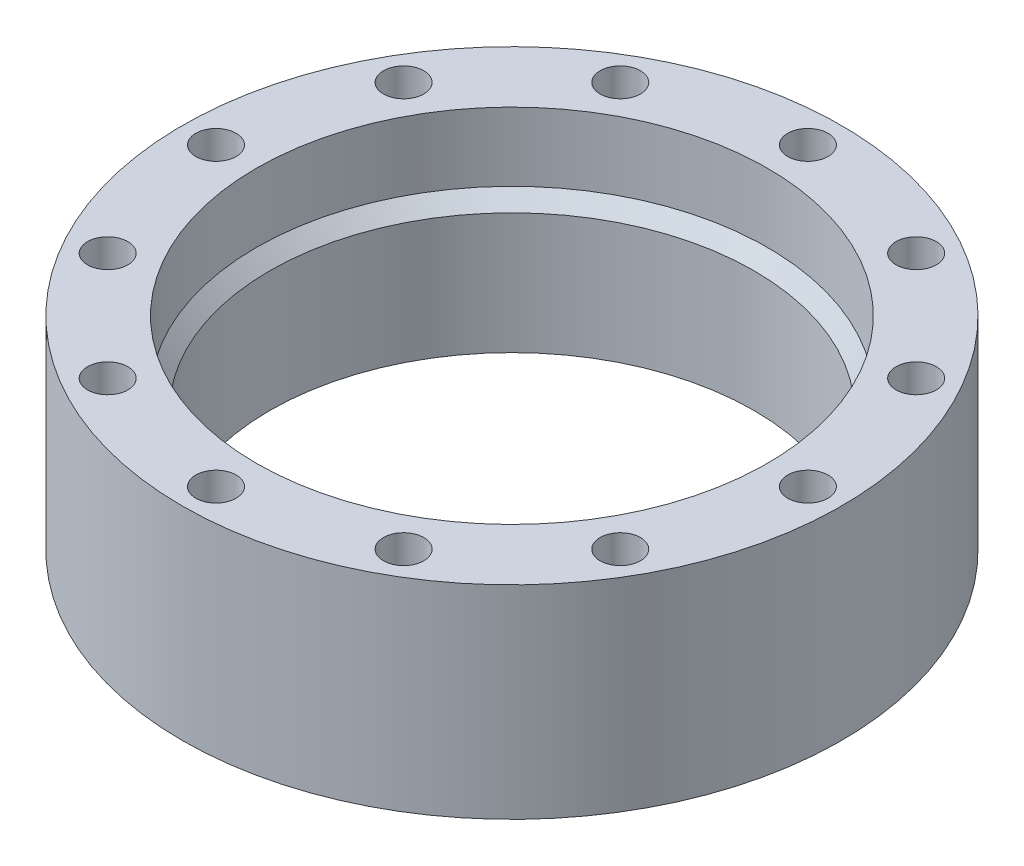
ISO-10303-21;
HEADER;
FILE_DESCRIPTION(('STEP AP214'),'2;1');
FILE_NAME('part.step','',(''),(''),'','','');
FILE_SCHEMA(('AUTOMOTIVE_DESIGN { 1 0 10303 214 1 1 1 1 }'));
ENDSEC;
DATA;
#1=APPLICATION_CONTEXT('core data for automotive mechanical design processes');
#2=APPLICATION_PROTOCOL_DEFINITION('international standard','automotive_design',2000,#1);
#3=PRODUCT_CONTEXT('',#1,'mechanical');
#4=PRODUCT('Part','Part','',(#3));
#5=PRODUCT_RELATED_PRODUCT_CATEGORY('part','',(#4));
#6=PRODUCT_DEFINITION_FORMATION('','',#4);
#7=PRODUCT_DEFINITION_CONTEXT('part definition',#1,'design');
#8=PRODUCT_DEFINITION('design','',#6,#7);
#9=PRODUCT_DEFINITION_SHAPE('','',#8);
#10=(LENGTH_UNIT() NAMED_UNIT(*) SI_UNIT(.MILLI.,.METRE.));
#11=(NAMED_UNIT(*) PLANE_ANGLE_UNIT() SI_UNIT($,.RADIAN.));
#12=(NAMED_UNIT(*) SI_UNIT($,.STERADIAN.) SOLID_ANGLE_UNIT());
#13=UNCERTAINTY_MEASURE_WITH_UNIT(LENGTH_MEASURE(1.E-05),#10,'distance_accuracy_value','');
#14=(GEOMETRIC_REPRESENTATION_CONTEXT(3) GLOBAL_UNCERTAINTY_ASSIGNED_CONTEXT((#13)) GLOBAL_UNIT_ASSIGNED_CONTEXT((#10,
#11,#12)) REPRESENTATION_CONTEXT('',''));
#15=CARTESIAN_POINT('',(0.,0.,0.));
#16=DIRECTION('',(0.,0.,1.));
#17=DIRECTION('',(1.,0.,0.));
#18=AXIS2_PLACEMENT_3D('',#15,#16,#17);
#19=CARTESIAN_POINT('',(0.,15.1,0.));
#20=DIRECTION('',(0.,1.,0.));
#21=DIRECTION('',(0.,0.,1.));
#22=AXIS2_PLACEMENT_3D('',#19,#20,#21);
#23=PLANE('',#22);
#24=CARTESIAN_POINT('',(-19.0525588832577,15.1,10.9999999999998));
#25=DIRECTION('',(0.,1.,0.));
#26=DIRECTION('',(0.,0.,1.));
#27=AXIS2_PLACEMENT_3D('',#24,#25,#26);
#28=CIRCLE('',#27,1.5);
#29=CARTESIAN_POINT('',(-19.0525588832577,15.1,12.4999999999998));
#30=VERTEX_POINT('',#29);
#31=EDGE_CURVE('E115',#30,#30,#28,.T.);
#32=ORIENTED_EDGE('',*,*,#31,.F.);
#33=EDGE_LOOP('',(#32));
#34=FACE_BOUND('',#33,.T.);
#35=CARTESIAN_POINT('',(-11.0000000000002,15.1,19.0525588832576));
#36=DIRECTION('',(0.,1.,0.));
#37=DIRECTION('',(0.,0.,1.));
#38=AXIS2_PLACEMENT_3D('',#35,#36,#37);
#39=CIRCLE('',#38,1.5);
#40=CARTESIAN_POINT('',(-11.0000000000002,15.1,20.5525588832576));
#41=VERTEX_POINT('',#40);
#42=EDGE_CURVE('E123',#41,#41,#39,.T.);
#43=ORIENTED_EDGE('',*,*,#42,.F.);
#44=EDGE_LOOP('',(#43));
#45=FACE_BOUND('',#44,.T.);
#46=CARTESIAN_POINT('',(-1.53602910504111E-13,15.1,22.));
#47=DIRECTION('',(0.,1.,0.));
#48=DIRECTION('',(0.,0.,1.));
#49=AXIS2_PLACEMENT_3D('',#46,#47,#48);
#50=CIRCLE('',#49,1.5);
#51=CARTESIAN_POINT('',(-1.53602910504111E-13,15.1,23.5));
#52=VERTEX_POINT('',#51);
#53=EDGE_CURVE('E129',#52,#52,#50,.T.);
#54=ORIENTED_EDGE('',*,*,#53,.F.);
#55=EDGE_LOOP('',(#54));
#56=FACE_BOUND('',#55,.T.);
#57=CARTESIAN_POINT('',(10.9999999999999,15.1,19.0525588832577));
#58=DIRECTION('',(0.,1.,0.));
#59=DIRECTION('',(0.,0.,1.));
#60=AXIS2_PLACEMENT_3D('',#57,#58,#59);
#61=CIRCLE('',#60,1.5);
#62=CARTESIAN_POINT('',(10.9999999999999,15.1,20.5525588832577));
#63=VERTEX_POINT('',#62);
#64=EDGE_CURVE('E83',#63,#63,#61,.T.);
#65=ORIENTED_EDGE('',*,*,#64,.F.);
#66=EDGE_LOOP('',(#65));
#67=FACE_BOUND('',#66,.T.);
#68=CARTESIAN_POINT('',(19.0525588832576,15.1,11.0000000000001));
#69=DIRECTION('',(0.,1.,0.));
#70=DIRECTION('',(0.,0.,1.));
#71=AXIS2_PLACEMENT_3D('',#68,#69,#70);
#72=CIRCLE('',#71,1.5);
#73=CARTESIAN_POINT('',(19.0525588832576,15.1,12.5000000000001));
#74=VERTEX_POINT('',#73);
#75=EDGE_CURVE('E80',#74,#74,#72,.T.);
#76=ORIENTED_EDGE('',*,*,#75,.F.);
#77=EDGE_LOOP('',(#76));
#78=FACE_BOUND('',#77,.T.);
#79=CARTESIAN_POINT('',(22.,15.1,0.));
#80=DIRECTION('',(0.,1.,0.));
#81=DIRECTION('',(0.,0.,1.));
#82=AXIS2_PLACEMENT_3D('',#79,#80,#81);
#83=CIRCLE('',#82,1.5);
#84=CARTESIAN_POINT('',(22.,15.1,1.50000000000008));
#85=VERTEX_POINT('',#84);
#86=EDGE_CURVE('E90',#85,#85,#83,.T.);
#87=ORIENTED_EDGE('',*,*,#86,.F.);
#88=EDGE_LOOP('',(#87));
#89=FACE_BOUND('',#88,.T.);
#90=CARTESIAN_POINT('',(19.0525588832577,15.1,-11.));
#91=DIRECTION('',(0.,1.,0.));
#92=DIRECTION('',(0.,0.,1.));
#93=AXIS2_PLACEMENT_3D('',#90,#91,#92);
#94=CIRCLE('',#93,1.5);
#95=CARTESIAN_POINT('',(19.0525588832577,15.1,-9.49999999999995));
#96=VERTEX_POINT('',#95);
#97=EDGE_CURVE('E100',#96,#96,#94,.T.);
#98=ORIENTED_EDGE('',*,*,#97,.F.);
#99=EDGE_LOOP('',(#98));
#100=FACE_BOUND('',#99,.T.);
#101=CARTESIAN_POINT('',(11.,15.1,-19.0525588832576));
#102=DIRECTION('',(0.,1.,0.));
#103=DIRECTION('',(0.,0.,1.));
#104=AXIS2_PLACEMENT_3D('',#101,#102,#103);
#105=CIRCLE('',#104,1.5);
#106=CARTESIAN_POINT('',(11.,15.1,-17.5525588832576));
#107=VERTEX_POINT('',#106);
#108=EDGE_CURVE('E75',#107,#107,#105,.T.);
#109=ORIENTED_EDGE('',*,*,#108,.F.);
#110=EDGE_LOOP('',(#109));
#111=FACE_BOUND('',#110,.T.);
#112=CARTESIAN_POINT('',(-22.,15.1,-2.3041549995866E-13));
#113=DIRECTION('',(0.,1.,0.));
#114=DIRECTION('',(0.,0.,1.));
#115=AXIS2_PLACEMENT_3D('',#112,#113,#114);
#116=CIRCLE('',#115,1.5);
#117=CARTESIAN_POINT('',(-22.,15.1,1.49999999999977));
#118=VERTEX_POINT('',#117);
#119=EDGE_CURVE('E114',#118,#118,#116,.T.);
#120=ORIENTED_EDGE('',*,*,#119,.F.);
#121=EDGE_LOOP('',(#120));
#122=FACE_BOUND('',#121,.T.);
#123=CARTESIAN_POINT('',(-19.0525588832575,15.1,-11.0000000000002));
#124=DIRECTION('',(0.,1.,0.));
#125=DIRECTION('',(0.,0.,1.));
#126=AXIS2_PLACEMENT_3D('',#123,#124,#125);
#127=CIRCLE('',#126,1.5);
#128=CARTESIAN_POINT('',(-19.0525588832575,15.1,-9.50000000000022));
#129=VERTEX_POINT('',#128);
#130=EDGE_CURVE('E153',#129,#129,#127,.T.);
#131=ORIENTED_EDGE('',*,*,#130,.F.);
#132=EDGE_LOOP('',(#131));
#133=FACE_BOUND('',#132,.T.);
#134=CARTESIAN_POINT('',(-10.9999999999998,15.1,-19.0525588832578));
#135=DIRECTION('',(0.,1.,0.));
#136=DIRECTION('',(0.,0.,1.));
#137=AXIS2_PLACEMENT_3D('',#134,#135,#136);
#138=CIRCLE('',#137,1.5);
#139=CARTESIAN_POINT('',(-10.9999999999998,15.1,-17.5525588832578));
#140=VERTEX_POINT('',#139);
#141=EDGE_CURVE('E145',#140,#140,#138,.T.);
#142=ORIENTED_EDGE('',*,*,#141,.F.);
#143=EDGE_LOOP('',(#142));
#144=FACE_BOUND('',#143,.T.);
#145=CARTESIAN_POINT('',(0.,15.1,-22.));
#146=DIRECTION('',(0.,1.,0.));
#147=DIRECTION('',(0.,0.,1.));
#148=AXIS2_PLACEMENT_3D('',#145,#146,#147);
#149=CIRCLE('',#148,1.5);
#150=CARTESIAN_POINT('',(0.,15.1,-20.5));
#151=VERTEX_POINT('',#150);
#152=EDGE_CURVE('E66',#151,#151,#149,.T.);
#153=ORIENTED_EDGE('',*,*,#152,.F.);
#154=EDGE_LOOP('',(#153));
#155=FACE_BOUND('',#154,.T.);
#156=CARTESIAN_POINT('',(0.,15.1,0.));
#157=DIRECTION('',(0.,1.,0.));
#158=DIRECTION('',(0.,0.,1.));
#159=AXIS2_PLACEMENT_3D('',#156,#157,#158);
#160=CIRCLE('',#159,24.5);
#161=CARTESIAN_POINT('',(0.,15.1,24.5));
#162=VERTEX_POINT('',#161);
#163=EDGE_CURVE('E51',#162,#162,#160,.T.);
#164=ORIENTED_EDGE('',*,*,#163,.T.);
#165=EDGE_LOOP('',(#164));
#166=FACE_BOUND('',#165,.T.);
#167=CARTESIAN_POINT('',(0.,15.1,0.));
#168=DIRECTION('',(0.,1.,0.));
#169=DIRECTION('',(0.,0.,1.));
#170=AXIS2_PLACEMENT_3D('',#167,#168,#169);
#171=CIRCLE('',#170,19.);
#172=CARTESIAN_POINT('',(0.,15.1,19.));
#173=VERTEX_POINT('',#172);
#174=EDGE_CURVE('E62',#173,#173,#171,.T.);
#175=ORIENTED_EDGE('',*,*,#174,.F.);
#176=EDGE_LOOP('',(#175));
#177=FACE_BOUND('',#176,.T.);
#178=ADVANCED_FACE('F43',(#34,#45,#56,#67,#78,#89,#100,#111,#122,#133,#144,#155,#166,#177),#23,.T.);
#179=CARTESIAN_POINT('',(0.,0.,0.));
#180=DIRECTION('',(0.,1.,0.));
#181=DIRECTION('',(0.,0.,1.));
#182=AXIS2_PLACEMENT_3D('',#179,#180,#181);
#183=PLANE('',#182);
#184=CARTESIAN_POINT('',(0.,0.,0.));
#185=DIRECTION('',(0.,1.,0.));
#186=DIRECTION('',(0.,0.,1.));
#187=AXIS2_PLACEMENT_3D('',#184,#185,#186);
#188=CIRCLE('',#187,24.5);
#189=CARTESIAN_POINT('',(0.,0.,24.5));
#190=VERTEX_POINT('',#189);
#191=EDGE_CURVE('E57',#190,#190,#188,.T.);
#192=ORIENTED_EDGE('',*,*,#191,.F.);
#193=EDGE_LOOP('',(#192));
#194=FACE_BOUND('',#193,.T.);
#195=CARTESIAN_POINT('',(0.,-1.80405208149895E-13,0.));
#196=DIRECTION('',(0.,-1.,0.));
#197=DIRECTION('',(1.,0.,0.));
#198=AXIS2_PLACEMENT_3D('',#195,#196,#197);
#199=CIRCLE('',#198,18.);
#200=CARTESIAN_POINT('',(18.,0.,0.));
#201=VERTEX_POINT('',#200);
#202=EDGE_CURVE('E144',#201,#201,#199,.T.);
#203=ORIENTED_EDGE('',*,*,#202,.F.);
#204=EDGE_LOOP('',(#203));
#205=FACE_BOUND('',#204,.T.);
#206=ADVANCED_FACE('F190',(#194,#205),#183,.F.);
#207=CARTESIAN_POINT('',(0.,15.1,0.));
#208=DIRECTION('',(0.,-1.,0.));
#209=DIRECTION('',(0.,0.,-1.));
#210=AXIS2_PLACEMENT_3D('',#207,#208,#209);
#211=CYLINDRICAL_SURFACE('',#210,24.5);
#212=ORIENTED_EDGE('',*,*,#163,.F.);
#213=EDGE_LOOP('',(#212));
#214=FACE_BOUND('',#213,.T.);
#215=ORIENTED_EDGE('',*,*,#191,.T.);
#216=EDGE_LOOP('',(#215));
#217=FACE_BOUND('',#216,.T.);
#218=ADVANCED_FACE('F44',(#214,#217),#211,.T.);
#219=CARTESIAN_POINT('',(0.,15.1,0.));
#220=DIRECTION('',(0.,-1.,0.));
#221=DIRECTION('',(0.,0.,-1.));
#222=AXIS2_PLACEMENT_3D('',#219,#220,#221);
#223=CYLINDRICAL_SURFACE('',#222,19.);
#224=CARTESIAN_POINT('',(-1.01670879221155E-13,9.99999999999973,0.));
#225=DIRECTION('',(0.,1.,0.));
#226=DIRECTION('',(-1.,0.,0.));
#227=AXIS2_PLACEMENT_3D('',#224,#225,#226);
#228=CIRCLE('',#227,19.);
#229=CARTESIAN_POINT('',(-19.0000000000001,9.99999999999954,0.));
#230=VERTEX_POINT('',#229);
#231=EDGE_CURVE('E10',#230,#230,#228,.T.);
#232=ORIENTED_EDGE('',*,*,#231,.F.);
#233=EDGE_LOOP('',(#232));
#234=FACE_BOUND('',#233,.T.);
#235=ORIENTED_EDGE('',*,*,#174,.T.);
#236=EDGE_LOOP('',(#235));
#237=FACE_BOUND('',#236,.T.);
#238=ADVANCED_FACE('F205',(#234,#237),#223,.F.);
#239=CARTESIAN_POINT('',(0.,8.1,-22.));
#240=DIRECTION('',(0.,1.,0.));
#241=DIRECTION('',(0.,0.,1.));
#242=AXIS2_PLACEMENT_3D('',#239,#240,#241);
#243=CYLINDRICAL_SURFACE('',#242,1.5);
#244=CARTESIAN_POINT('',(0.,8.1,-22.));
#245=DIRECTION('',(0.,1.,0.));
#246=DIRECTION('',(0.,0.,1.));
#247=AXIS2_PLACEMENT_3D('',#244,#245,#246);
#248=CIRCLE('',#247,1.5);
#249=CARTESIAN_POINT('',(0.,8.1,-20.5));
#250=VERTEX_POINT('',#249);
#251=EDGE_CURVE('E70',#250,#250,#248,.T.);
#252=ORIENTED_EDGE('',*,*,#251,.F.);
#253=EDGE_LOOP('',(#252));
#254=FACE_BOUND('',#253,.T.);
#255=ORIENTED_EDGE('',*,*,#152,.T.);
#256=EDGE_LOOP('',(#255));
#257=FACE_BOUND('',#256,.T.);
#258=ADVANCED_FACE('F204',(#254,#257),#243,.F.);
#259=CARTESIAN_POINT('',(0.,8.1,-22.));
#260=DIRECTION('',(0.,1.,0.));
#261=DIRECTION('',(0.,0.,1.));
#262=AXIS2_PLACEMENT_3D('',#259,#260,#261);
#263=PLANE('',#262);
#264=ORIENTED_EDGE('',*,*,#251,.T.);
#265=EDGE_LOOP('',(#264));
#266=FACE_BOUND('',#265,.T.);
#267=ADVANCED_FACE('F210',(#266),#263,.T.);
#268=CARTESIAN_POINT('',(-10.9999999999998,8.1,-19.0525588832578));
#269=DIRECTION('',(0.,1.,0.));
#270=DIRECTION('',(0.,0.,1.));
#271=AXIS2_PLACEMENT_3D('',#268,#269,#270);
#272=CYLINDRICAL_SURFACE('',#271,1.5);
#273=CARTESIAN_POINT('',(-10.9999999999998,8.1,-19.0525588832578));
#274=DIRECTION('',(0.,1.,0.));
#275=DIRECTION('',(0.,0.,1.));
#276=AXIS2_PLACEMENT_3D('',#273,#274,#275);
#277=CIRCLE('',#276,1.5);
#278=CARTESIAN_POINT('',(-10.9999999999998,8.1,-17.5525588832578));
#279=VERTEX_POINT('',#278);
#280=EDGE_CURVE('E137',#279,#279,#277,.T.);
#281=ORIENTED_EDGE('',*,*,#280,.F.);
#282=EDGE_LOOP('',(#281));
#283=FACE_BOUND('',#282,.T.);
#284=ORIENTED_EDGE('',*,*,#141,.T.);
#285=EDGE_LOOP('',(#284));
#286=FACE_BOUND('',#285,.T.);
#287=ADVANCED_FACE('F211',(#283,#286),#272,.F.);
#288=CARTESIAN_POINT('',(-10.9999999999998,8.1,-19.0525588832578));
#289=DIRECTION('',(0.,1.,0.));
#290=DIRECTION('',(0.,0.,1.));
#291=AXIS2_PLACEMENT_3D('',#288,#289,#290);
#292=PLANE('',#291);
#293=ORIENTED_EDGE('',*,*,#280,.T.);
#294=EDGE_LOOP('',(#293));
#295=FACE_BOUND('',#294,.T.);
#296=ADVANCED_FACE('F272',(#295),#292,.T.);
#297=CARTESIAN_POINT('',(-19.0525588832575,8.1,-11.0000000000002));
#298=DIRECTION('',(0.,1.,0.));
#299=DIRECTION('',(0.,0.,1.));
#300=AXIS2_PLACEMENT_3D('',#297,#298,#299);
#301=CYLINDRICAL_SURFACE('',#300,1.5);
#302=CARTESIAN_POINT('',(-19.0525588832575,8.1,-11.0000000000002));
#303=DIRECTION('',(0.,1.,0.));
#304=DIRECTION('',(0.,0.,1.));
#305=AXIS2_PLACEMENT_3D('',#302,#303,#304);
#306=CIRCLE('',#305,1.5);
#307=CARTESIAN_POINT('',(-19.0525588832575,8.1,-9.50000000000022));
#308=VERTEX_POINT('',#307);
#309=EDGE_CURVE('E149',#308,#308,#306,.T.);
#310=ORIENTED_EDGE('',*,*,#309,.F.);
#311=EDGE_LOOP('',(#310));
#312=FACE_BOUND('',#311,.T.);
#313=ORIENTED_EDGE('',*,*,#130,.T.);
#314=EDGE_LOOP('',(#313));
#315=FACE_BOUND('',#314,.T.);
#316=ADVANCED_FACE('F277',(#312,#315),#301,.F.);
#317=CARTESIAN_POINT('',(-19.0525588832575,8.1,-11.0000000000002));
#318=DIRECTION('',(0.,1.,0.));
#319=DIRECTION('',(0.,0.,1.));
#320=AXIS2_PLACEMENT_3D('',#317,#318,#319);
#321=PLANE('',#320);
#322=ORIENTED_EDGE('',*,*,#309,.T.);
#323=EDGE_LOOP('',(#322));
#324=FACE_BOUND('',#323,.T.);
#325=ADVANCED_FACE('F281',(#324),#321,.T.);
#326=CARTESIAN_POINT('',(-22.,8.1,-2.3041549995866E-13));
#327=DIRECTION('',(0.,1.,0.));
#328=DIRECTION('',(0.,0.,1.));
#329=AXIS2_PLACEMENT_3D('',#326,#327,#328);
#330=CYLINDRICAL_SURFACE('',#329,1.5);
#331=CARTESIAN_POINT('',(-22.,8.1,-2.3041549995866E-13));
#332=DIRECTION('',(0.,1.,0.));
#333=DIRECTION('',(0.,0.,1.));
#334=AXIS2_PLACEMENT_3D('',#331,#332,#333);
#335=CIRCLE('',#334,1.5);
#336=CARTESIAN_POINT('',(-22.,8.1,1.49999999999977));
#337=VERTEX_POINT('',#336);
#338=EDGE_CURVE('E160',#337,#337,#335,.T.);
#339=ORIENTED_EDGE('',*,*,#338,.F.);
#340=EDGE_LOOP('',(#339));
#341=FACE_BOUND('',#340,.T.);
#342=ORIENTED_EDGE('',*,*,#119,.T.);
#343=EDGE_LOOP('',(#342));
#344=FACE_BOUND('',#343,.T.);
#345=ADVANCED_FACE('F283',(#341,#344),#330,.F.);
#346=CARTESIAN_POINT('',(-22.,8.1,-2.3041549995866E-13));
#347=DIRECTION('',(0.,1.,0.));
#348=DIRECTION('',(0.,0.,1.));
#349=AXIS2_PLACEMENT_3D('',#346,#347,#348);
#350=PLANE('',#349);
#351=ORIENTED_EDGE('',*,*,#338,.T.);
#352=EDGE_LOOP('',(#351));
#353=FACE_BOUND('',#352,.T.);
#354=ADVANCED_FACE('F243',(#353),#350,.T.);
#355=CARTESIAN_POINT('',(11.,8.1,-19.0525588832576));
#356=DIRECTION('',(0.,1.,0.));
#357=DIRECTION('',(0.,0.,1.));
#358=AXIS2_PLACEMENT_3D('',#355,#356,#357);
#359=CYLINDRICAL_SURFACE('',#358,1.5);
#360=CARTESIAN_POINT('',(11.,8.1,-19.0525588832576));
#361=DIRECTION('',(0.,1.,0.));
#362=DIRECTION('',(0.,0.,1.));
#363=AXIS2_PLACEMENT_3D('',#360,#361,#362);
#364=CIRCLE('',#363,1.5);
#365=CARTESIAN_POINT('',(11.,8.1,-17.5525588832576));
#366=VERTEX_POINT('',#365);
#367=EDGE_CURVE('E101',#366,#366,#364,.T.);
#368=ORIENTED_EDGE('',*,*,#367,.F.);
#369=EDGE_LOOP('',(#368));
#370=FACE_BOUND('',#369,.T.);
#371=ORIENTED_EDGE('',*,*,#108,.T.);
#372=EDGE_LOOP('',(#371));
#373=FACE_BOUND('',#372,.T.);
#374=ADVANCED_FACE('F241',(#370,#373),#359,.F.);
#375=CARTESIAN_POINT('',(11.,8.1,-19.0525588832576));
#376=DIRECTION('',(0.,1.,0.));
#377=DIRECTION('',(0.,0.,1.));
#378=AXIS2_PLACEMENT_3D('',#375,#376,#377);
#379=PLANE('',#378);
#380=ORIENTED_EDGE('',*,*,#367,.T.);
#381=EDGE_LOOP('',(#380));
#382=FACE_BOUND('',#381,.T.);
#383=ADVANCED_FACE('F240',(#382),#379,.T.);
#384=CARTESIAN_POINT('',(19.0525588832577,8.1,-11.));
#385=DIRECTION('',(0.,1.,0.));
#386=DIRECTION('',(0.,0.,1.));
#387=AXIS2_PLACEMENT_3D('',#384,#385,#386);
#388=CYLINDRICAL_SURFACE('',#387,1.5);
#389=CARTESIAN_POINT('',(19.0525588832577,8.1,-11.));
#390=DIRECTION('',(0.,1.,0.));
#391=DIRECTION('',(0.,0.,1.));
#392=AXIS2_PLACEMENT_3D('',#389,#390,#391);
#393=CIRCLE('',#392,1.5);
#394=CARTESIAN_POINT('',(19.0525588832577,8.1,-9.49999999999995));
#395=VERTEX_POINT('',#394);
#396=EDGE_CURVE('E91',#395,#395,#393,.T.);
#397=ORIENTED_EDGE('',*,*,#396,.F.);
#398=EDGE_LOOP('',(#397));
#399=FACE_BOUND('',#398,.T.);
#400=ORIENTED_EDGE('',*,*,#97,.T.);
#401=EDGE_LOOP('',(#400));
#402=FACE_BOUND('',#401,.T.);
#403=ADVANCED_FACE('F231',(#399,#402),#388,.F.);
#404=CARTESIAN_POINT('',(19.0525588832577,8.1,-11.));
#405=DIRECTION('',(0.,1.,0.));
#406=DIRECTION('',(0.,0.,1.));
#407=AXIS2_PLACEMENT_3D('',#404,#405,#406);
#408=PLANE('',#407);
#409=ORIENTED_EDGE('',*,*,#396,.T.);
#410=EDGE_LOOP('',(#409));
#411=FACE_BOUND('',#410,.T.);
#412=ADVANCED_FACE('F228',(#411),#408,.T.);
#413=CARTESIAN_POINT('',(22.,8.1,0.));
#414=DIRECTION('',(0.,1.,0.));
#415=DIRECTION('',(0.,0.,1.));
#416=AXIS2_PLACEMENT_3D('',#413,#414,#415);
#417=CYLINDRICAL_SURFACE('',#416,1.5);
#418=CARTESIAN_POINT('',(22.,8.1,0.));
#419=DIRECTION('',(0.,1.,0.));
#420=DIRECTION('',(0.,0.,1.));
#421=AXIS2_PLACEMENT_3D('',#418,#419,#420);
#422=CIRCLE('',#421,1.5);
#423=CARTESIAN_POINT('',(22.,8.1,1.50000000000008));
#424=VERTEX_POINT('',#423);
#425=EDGE_CURVE('E82',#424,#424,#422,.T.);
#426=ORIENTED_EDGE('',*,*,#425,.F.);
#427=EDGE_LOOP('',(#426));
#428=FACE_BOUND('',#427,.T.);
#429=ORIENTED_EDGE('',*,*,#86,.T.);
#430=EDGE_LOOP('',(#429));
#431=FACE_BOUND('',#430,.T.);
#432=ADVANCED_FACE('F223',(#428,#431),#417,.F.);
#433=CARTESIAN_POINT('',(22.,8.1,0.));
#434=DIRECTION('',(0.,1.,0.));
#435=DIRECTION('',(0.,0.,1.));
#436=AXIS2_PLACEMENT_3D('',#433,#434,#435);
#437=PLANE('',#436);
#438=ORIENTED_EDGE('',*,*,#425,.T.);
#439=EDGE_LOOP('',(#438));
#440=FACE_BOUND('',#439,.T.);
#441=ADVANCED_FACE('F222',(#440),#437,.T.);
#442=CARTESIAN_POINT('',(19.0525588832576,8.1,11.0000000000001));
#443=DIRECTION('',(0.,1.,0.));
#444=DIRECTION('',(0.,0.,1.));
#445=AXIS2_PLACEMENT_3D('',#442,#443,#444);
#446=CYLINDRICAL_SURFACE('',#445,1.5);
#447=CARTESIAN_POINT('',(19.0525588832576,8.1,11.0000000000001));
#448=DIRECTION('',(0.,1.,0.));
#449=DIRECTION('',(0.,0.,1.));
#450=AXIS2_PLACEMENT_3D('',#447,#448,#449);
#451=CIRCLE('',#450,1.5);
#452=CARTESIAN_POINT('',(19.0525588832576,8.1,12.5000000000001));
#453=VERTEX_POINT('',#452);
#454=EDGE_CURVE('E76',#453,#453,#451,.T.);
#455=ORIENTED_EDGE('',*,*,#454,.F.);
#456=EDGE_LOOP('',(#455));
#457=FACE_BOUND('',#456,.T.);
#458=ORIENTED_EDGE('',*,*,#75,.T.);
#459=EDGE_LOOP('',(#458));
#460=FACE_BOUND('',#459,.T.);
#461=ADVANCED_FACE('F220',(#457,#460),#446,.F.);
#462=CARTESIAN_POINT('',(19.0525588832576,8.1,11.0000000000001));
#463=DIRECTION('',(0.,1.,0.));
#464=DIRECTION('',(0.,0.,1.));
#465=AXIS2_PLACEMENT_3D('',#462,#463,#464);
#466=PLANE('',#465);
#467=ORIENTED_EDGE('',*,*,#454,.T.);
#468=EDGE_LOOP('',(#467));
#469=FACE_BOUND('',#468,.T.);
#470=ADVANCED_FACE('F213',(#469),#466,.T.);
#471=CARTESIAN_POINT('',(10.9999999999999,8.1,19.0525588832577));
#472=DIRECTION('',(0.,1.,0.));
#473=DIRECTION('',(0.,0.,1.));
#474=AXIS2_PLACEMENT_3D('',#471,#472,#473);
#475=CYLINDRICAL_SURFACE('',#474,1.5);
#476=CARTESIAN_POINT('',(10.9999999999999,8.1,19.0525588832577));
#477=DIRECTION('',(0.,1.,0.));
#478=DIRECTION('',(0.,0.,1.));
#479=AXIS2_PLACEMENT_3D('',#476,#477,#478);
#480=CIRCLE('',#479,1.5);
#481=CARTESIAN_POINT('',(10.9999999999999,8.1,20.5525588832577));
#482=VERTEX_POINT('',#481);
#483=EDGE_CURVE('E134',#482,#482,#480,.T.);
#484=ORIENTED_EDGE('',*,*,#483,.F.);
#485=EDGE_LOOP('',(#484));
#486=FACE_BOUND('',#485,.T.);
#487=ORIENTED_EDGE('',*,*,#64,.T.);
#488=EDGE_LOOP('',(#487));
#489=FACE_BOUND('',#488,.T.);
#490=ADVANCED_FACE('F216',(#486,#489),#475,.F.);
#491=CARTESIAN_POINT('',(10.9999999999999,8.1,19.0525588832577));
#492=DIRECTION('',(0.,1.,0.));
#493=DIRECTION('',(0.,0.,1.));
#494=AXIS2_PLACEMENT_3D('',#491,#492,#493);
#495=PLANE('',#494);
#496=ORIENTED_EDGE('',*,*,#483,.T.);
#497=EDGE_LOOP('',(#496));
#498=FACE_BOUND('',#497,.T.);
#499=ADVANCED_FACE('F264',(#498),#495,.T.);
#500=CARTESIAN_POINT('',(-1.53602910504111E-13,8.1,22.));
#501=DIRECTION('',(0.,1.,0.));
#502=DIRECTION('',(0.,0.,1.));
#503=AXIS2_PLACEMENT_3D('',#500,#501,#502);
#504=CYLINDRICAL_SURFACE('',#503,1.5);
#505=CARTESIAN_POINT('',(-1.53602910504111E-13,8.1,22.));
#506=DIRECTION('',(0.,1.,0.));
#507=DIRECTION('',(0.,0.,1.));
#508=AXIS2_PLACEMENT_3D('',#505,#506,#507);
#509=CIRCLE('',#508,1.5);
#510=CARTESIAN_POINT('',(-1.53602910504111E-13,8.1,23.5));
#511=VERTEX_POINT('',#510);
#512=EDGE_CURVE('E122',#511,#511,#509,.T.);
#513=ORIENTED_EDGE('',*,*,#512,.F.);
#514=EDGE_LOOP('',(#513));
#515=FACE_BOUND('',#514,.T.);
#516=ORIENTED_EDGE('',*,*,#53,.T.);
#517=EDGE_LOOP('',(#516));
#518=FACE_BOUND('',#517,.T.);
#519=ADVANCED_FACE('F261',(#515,#518),#504,.F.);
#520=CARTESIAN_POINT('',(-1.53602910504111E-13,8.1,22.));
#521=DIRECTION('',(0.,1.,0.));
#522=DIRECTION('',(0.,0.,1.));
#523=AXIS2_PLACEMENT_3D('',#520,#521,#522);
#524=PLANE('',#523);
#525=ORIENTED_EDGE('',*,*,#512,.T.);
#526=EDGE_LOOP('',(#525));
#527=FACE_BOUND('',#526,.T.);
#528=ADVANCED_FACE('F260',(#527),#524,.T.);
#529=CARTESIAN_POINT('',(-11.0000000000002,8.1,19.0525588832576));
#530=DIRECTION('',(0.,1.,0.));
#531=DIRECTION('',(0.,0.,1.));
#532=AXIS2_PLACEMENT_3D('',#529,#530,#531);
#533=CYLINDRICAL_SURFACE('',#532,1.5);
#534=CARTESIAN_POINT('',(-11.0000000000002,8.1,19.0525588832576));
#535=DIRECTION('',(0.,1.,0.));
#536=DIRECTION('',(0.,0.,1.));
#537=AXIS2_PLACEMENT_3D('',#534,#535,#536);
#538=CIRCLE('',#537,1.5);
#539=CARTESIAN_POINT('',(-11.0000000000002,8.1,20.5525588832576));
#540=VERTEX_POINT('',#539);
#541=EDGE_CURVE('E117',#540,#540,#538,.T.);
#542=ORIENTED_EDGE('',*,*,#541,.F.);
#543=EDGE_LOOP('',(#542));
#544=FACE_BOUND('',#543,.T.);
#545=ORIENTED_EDGE('',*,*,#42,.T.);
#546=EDGE_LOOP('',(#545));
#547=FACE_BOUND('',#546,.T.);
#548=ADVANCED_FACE('F251',(#544,#547),#533,.F.);
#549=CARTESIAN_POINT('',(-11.0000000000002,8.1,19.0525588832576));
#550=DIRECTION('',(0.,1.,0.));
#551=DIRECTION('',(0.,0.,1.));
#552=AXIS2_PLACEMENT_3D('',#549,#550,#551);
#553=PLANE('',#552);
#554=ORIENTED_EDGE('',*,*,#541,.T.);
#555=EDGE_LOOP('',(#554));
#556=FACE_BOUND('',#555,.T.);
#557=ADVANCED_FACE('F249',(#556),#553,.T.);
#558=CARTESIAN_POINT('',(-19.0525588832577,8.1,10.9999999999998));
#559=DIRECTION('',(0.,1.,0.));
#560=DIRECTION('',(0.,0.,1.));
#561=AXIS2_PLACEMENT_3D('',#558,#559,#560);
#562=CYLINDRICAL_SURFACE('',#561,1.5);
#563=CARTESIAN_POINT('',(-19.0525588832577,8.1,10.9999999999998));
#564=DIRECTION('',(0.,1.,0.));
#565=DIRECTION('',(0.,0.,1.));
#566=AXIS2_PLACEMENT_3D('',#563,#564,#565);
#567=CIRCLE('',#566,1.5);
#568=CARTESIAN_POINT('',(-19.0525588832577,8.1,12.4999999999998));
#569=VERTEX_POINT('',#568);
#570=EDGE_CURVE('E107',#569,#569,#567,.T.);
#571=ORIENTED_EDGE('',*,*,#570,.F.);
#572=EDGE_LOOP('',(#571));
#573=FACE_BOUND('',#572,.T.);
#574=ORIENTED_EDGE('',*,*,#31,.T.);
#575=EDGE_LOOP('',(#574));
#576=FACE_BOUND('',#575,.T.);
#577=ADVANCED_FACE('F183',(#573,#576),#562,.F.);
#578=CARTESIAN_POINT('',(-19.0525588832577,8.1,10.9999999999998));
#579=DIRECTION('',(0.,1.,0.));
#580=DIRECTION('',(0.,0.,1.));
#581=AXIS2_PLACEMENT_3D('',#578,#579,#580);
#582=PLANE('',#581);
#583=ORIENTED_EDGE('',*,*,#570,.T.);
#584=EDGE_LOOP('',(#583));
#585=FACE_BOUND('',#584,.T.);
#586=ADVANCED_FACE('F178',(#585),#582,.T.);
#587=CARTESIAN_POINT('',(0.,0.,0.));
#588=DIRECTION('',(0.,-1.,0.));
#589=DIRECTION('',(1.,0.,0.));
#590=AXIS2_PLACEMENT_3D('',#587,#588,#589);
#591=CYLINDRICAL_SURFACE('',#590,18.);
#592=ORIENTED_EDGE('',*,*,#202,.T.);
#593=EDGE_LOOP('',(#592));
#594=FACE_BOUND('',#593,.T.);
#595=CARTESIAN_POINT('',(0.,8.99999999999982,0.));
#596=DIRECTION('',(0.,-1.,0.));
#597=DIRECTION('',(1.,0.,0.));
#598=AXIS2_PLACEMENT_3D('',#595,#596,#597);
#599=CIRCLE('',#598,18.0000000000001);
#600=CARTESIAN_POINT('',(18.,9.,0.));
#601=VERTEX_POINT('',#600);
#602=EDGE_CURVE('E170',#601,#601,#599,.T.);
#603=ORIENTED_EDGE('',*,*,#602,.F.);
#604=EDGE_LOOP('',(#603));
#605=FACE_BOUND('',#604,.T.);
#606=ADVANCED_FACE('F173',(#594,#605),#591,.F.);
#607=CARTESIAN_POINT('',(-1.01670879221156E-13,9.99999999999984,0.));
#608=DIRECTION('',(0.,1.,0.));
#609=DIRECTION('',(-1.,0.,0.));
#610=AXIS2_PLACEMENT_3D('',#607,#608,#609);
#611=CONICAL_SURFACE('',#610,19.0000000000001,0.785398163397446);
#612=ORIENTED_EDGE('',*,*,#602,.T.);
#613=EDGE_LOOP('',(#612));
#614=FACE_BOUND('',#613,.T.);
#615=ORIENTED_EDGE('',*,*,#231,.T.);
#616=EDGE_LOOP('',(#615));
#617=FACE_BOUND('',#616,.T.);
#618=ADVANCED_FACE('F172',(#614,#617),#611,.F.);
#619=CLOSED_SHELL('',(#178,#206,#218,#238,#258,#267,#287,#296,#316,#325,#345,#354,#374,#383,
#403,#412,#432,#441,#461,#470,#490,#499,#519,#528,#548,#557,#577,#586,#606,#618));
#620=MANIFOLD_SOLID_BREP('B2',#619);
#621=ADVANCED_BREP_SHAPE_REPRESENTATION('',(#18,#620),#14);
#622=SHAPE_DEFINITION_REPRESENTATION(#9,#621);
ENDSEC;
END-ISO-10303-21;
